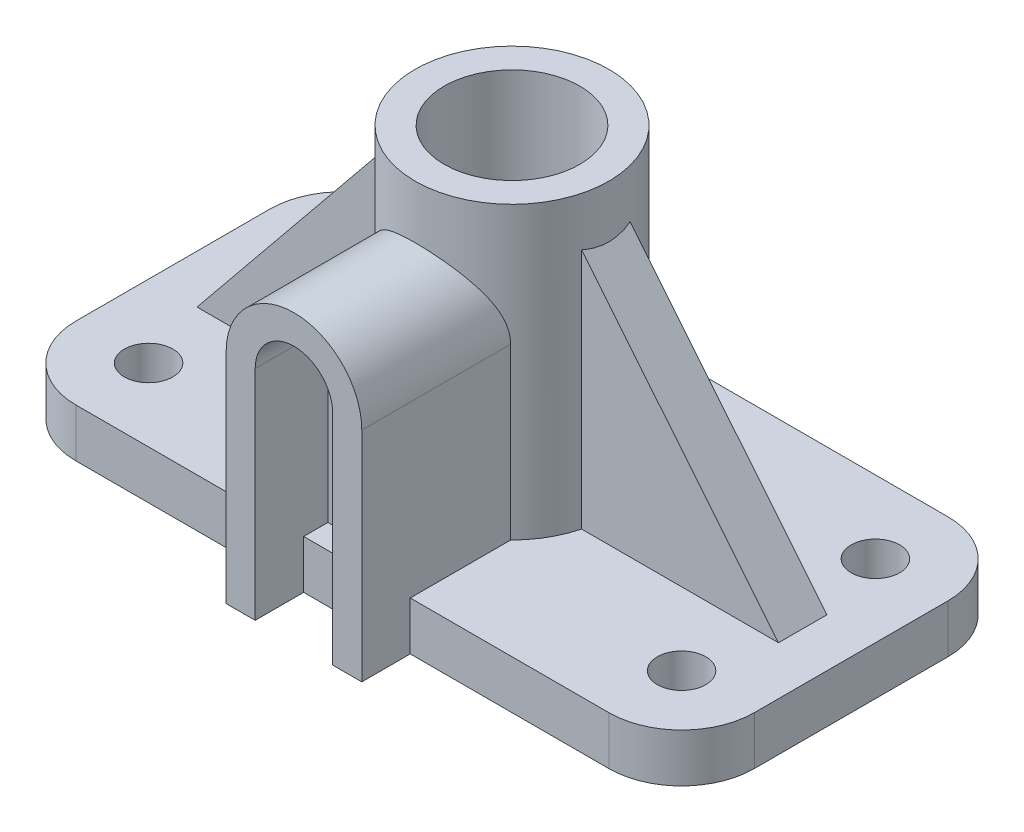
ISO-10303-21;
HEADER;
FILE_DESCRIPTION(('STEP AP214'),'2;1');
FILE_NAME('part.step','',(''),(''),'','','');
FILE_SCHEMA(('AUTOMOTIVE_DESIGN { 1 0 10303 214 1 1 1 1 }'));
ENDSEC;
DATA;
#1=APPLICATION_CONTEXT('core data for automotive mechanical design processes');
#2=APPLICATION_PROTOCOL_DEFINITION('international standard','automotive_design',2000,#1);
#3=PRODUCT_CONTEXT('',#1,'mechanical');
#4=PRODUCT('Part','Part','',(#3));
#5=PRODUCT_RELATED_PRODUCT_CATEGORY('part','',(#4));
#6=PRODUCT_DEFINITION_FORMATION('','',#4);
#7=PRODUCT_DEFINITION_CONTEXT('part definition',#1,'design');
#8=PRODUCT_DEFINITION('design','',#6,#7);
#9=PRODUCT_DEFINITION_SHAPE('','',#8);
#10=(LENGTH_UNIT() NAMED_UNIT(*) SI_UNIT(.MILLI.,.METRE.));
#11=(NAMED_UNIT(*) PLANE_ANGLE_UNIT() SI_UNIT($,.RADIAN.));
#12=(NAMED_UNIT(*) SI_UNIT($,.STERADIAN.) SOLID_ANGLE_UNIT());
#13=UNCERTAINTY_MEASURE_WITH_UNIT(LENGTH_MEASURE(1.E-05),#10,'distance_accuracy_value','');
#14=(GEOMETRIC_REPRESENTATION_CONTEXT(3) GLOBAL_UNCERTAINTY_ASSIGNED_CONTEXT((#13)) GLOBAL_UNIT_ASSIGNED_CONTEXT((#10,
#11,#12)) REPRESENTATION_CONTEXT('',''));
#15=CARTESIAN_POINT('',(0.,0.,0.));
#16=DIRECTION('',(0.,0.,1.));
#17=DIRECTION('',(1.,0.,0.));
#18=AXIS2_PLACEMENT_3D('',#15,#16,#17);
#19=CARTESIAN_POINT('',(-55.,10.,-20.));
#20=DIRECTION('',(0.,-1.,0.));
#21=DIRECTION('',(0.,0.,-1.));
#22=AXIS2_PLACEMENT_3D('',#19,#20,#21);
#23=PLANE('',#22);
#24=CARTESIAN_POINT('',(-55.,10.,-20.));
#25=DIRECTION('',(0.,1.,0.));
#26=DIRECTION('',(0.,0.,1.));
#27=AXIS2_PLACEMENT_3D('',#24,#25,#26);
#28=CIRCLE('',#27,5.);
#29=CARTESIAN_POINT('',(-55.,10.,-15.));
#30=VERTEX_POINT('',#29);
#31=EDGE_CURVE('E437',#30,#30,#28,.T.);
#32=ORIENTED_EDGE('',*,*,#31,.F.);
#33=EDGE_LOOP('',(#32));
#34=FACE_BOUND('',#33,.T.);
#35=CARTESIAN_POINT('',(55.,10.,-20.));
#36=DIRECTION('',(0.,1.,0.));
#37=DIRECTION('',(0.,0.,1.));
#38=AXIS2_PLACEMENT_3D('',#35,#36,#37);
#39=CIRCLE('',#38,5.);
#40=CARTESIAN_POINT('',(55.,10.,-15.));
#41=VERTEX_POINT('',#40);
#42=EDGE_CURVE('E449',#41,#41,#39,.T.);
#43=ORIENTED_EDGE('',*,*,#42,.F.);
#44=EDGE_LOOP('',(#43));
#45=FACE_BOUND('',#44,.T.);
#46=CARTESIAN_POINT('',(55.,10.,20.));
#47=DIRECTION('',(0.,1.,0.));
#48=DIRECTION('',(0.,0.,1.));
#49=AXIS2_PLACEMENT_3D('',#46,#47,#48);
#50=CIRCLE('',#49,5.);
#51=CARTESIAN_POINT('',(55.,10.,25.));
#52=VERTEX_POINT('',#51);
#53=EDGE_CURVE('E443',#52,#52,#50,.T.);
#54=ORIENTED_EDGE('',*,*,#53,.F.);
#55=EDGE_LOOP('',(#54));
#56=FACE_BOUND('',#55,.T.);
#57=CARTESIAN_POINT('',(-55.,10.,20.));
#58=DIRECTION('',(0.,1.,0.));
#59=DIRECTION('',(0.,0.,1.));
#60=AXIS2_PLACEMENT_3D('',#57,#58,#59);
#61=CIRCLE('',#60,5.);
#62=CARTESIAN_POINT('',(-55.,10.,25.));
#63=VERTEX_POINT('',#62);
#64=EDGE_CURVE('E431',#63,#63,#61,.T.);
#65=ORIENTED_EDGE('',*,*,#64,.F.);
#66=EDGE_LOOP('',(#65));
#67=FACE_BOUND('',#66,.T.);
#68=DIRECTION('',(1.,0.,0.));
#69=VECTOR('',#68,1.);
#70=CARTESIAN_POINT('',(-55.,10.,35.));
#71=LINE('',#70,#69);
#72=CARTESIAN_POINT('',(-55.,10.,35.));
#73=VERTEX_POINT('',#72);
#74=CARTESIAN_POINT('',(-14.,10.,35.));
#75=VERTEX_POINT('',#74);
#76=EDGE_CURVE('E464',#73,#75,#71,.T.);
#77=ORIENTED_EDGE('',*,*,#76,.T.);
#78=DIRECTION('',(0.,0.,-1.));
#79=VECTOR('',#78,1.);
#80=CARTESIAN_POINT('',(-14.,10.,-20.));
#81=LINE('',#80,#79);
#82=CARTESIAN_POINT('',(-14.,10.,14.2828568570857));
#83=VERTEX_POINT('',#82);
#84=EDGE_CURVE('E373',#75,#83,#81,.T.);
#85=ORIENTED_EDGE('',*,*,#84,.T.);
#86=CARTESIAN_POINT('',(0.,10.,0.));
#87=DIRECTION('',(0.,-1.,0.));
#88=DIRECTION('',(0.,0.,-1.));
#89=AXIS2_PLACEMENT_3D('',#86,#87,#88);
#90=CIRCLE('',#89,20.);
#91=CARTESIAN_POINT('',(-19.3649167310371,10.,5.));
#92=VERTEX_POINT('',#91);
#93=EDGE_CURVE('E40',#92,#83,#90,.F.);
#94=ORIENTED_EDGE('',*,*,#93,.F.);
#95=DIRECTION('',(-1.,0.,0.));
#96=VECTOR('',#95,1.);
#97=CARTESIAN_POINT('',(-55.,10.,5.));
#98=LINE('',#97,#96);
#99=CARTESIAN_POINT('',(-60.,10.,5.));
#100=VERTEX_POINT('',#99);
#101=EDGE_CURVE('E410',#92,#100,#98,.T.);
#102=ORIENTED_EDGE('',*,*,#101,.T.);
#103=DIRECTION('',(0.,0.,-1.));
#104=VECTOR('',#103,1.);
#105=CARTESIAN_POINT('',(-60.,10.,-20.));
#106=LINE('',#105,#104);
#107=CARTESIAN_POINT('',(-60.,10.,-5.));
#108=VERTEX_POINT('',#107);
#109=EDGE_CURVE('E415',#100,#108,#106,.T.);
#110=ORIENTED_EDGE('',*,*,#109,.T.);
#111=DIRECTION('',(-1.,0.,0.));
#112=VECTOR('',#111,1.);
#113=CARTESIAN_POINT('',(-55.,10.,-5.));
#114=LINE('',#113,#112);
#115=CARTESIAN_POINT('',(-19.3649167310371,10.,-5.));
#116=VERTEX_POINT('',#115);
#117=EDGE_CURVE('E404',#116,#108,#114,.T.);
#118=ORIENTED_EDGE('',*,*,#117,.F.);
#119=CARTESIAN_POINT('',(19.3649167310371,10.,-5.));
#120=VERTEX_POINT('',#119);
#121=EDGE_CURVE('E517',#120,#116,#90,.F.);
#122=ORIENTED_EDGE('',*,*,#121,.F.);
#123=DIRECTION('',(-1.,0.,0.));
#124=VECTOR('',#123,1.);
#125=CARTESIAN_POINT('',(-55.,10.,-5.));
#126=LINE('',#125,#124);
#127=CARTESIAN_POINT('',(60.,10.,-5.));
#128=VERTEX_POINT('',#127);
#129=EDGE_CURVE('E383',#128,#120,#126,.T.);
#130=ORIENTED_EDGE('',*,*,#129,.F.);
#131=DIRECTION('',(0.,0.,-1.));
#132=VECTOR('',#131,1.);
#133=CARTESIAN_POINT('',(60.,10.,-20.));
#134=LINE('',#133,#132);
#135=CARTESIAN_POINT('',(60.,10.,5.));
#136=VERTEX_POINT('',#135);
#137=EDGE_CURVE('E395',#128,#136,#134,.F.);
#138=ORIENTED_EDGE('',*,*,#137,.T.);
#139=DIRECTION('',(-1.,0.,0.));
#140=VECTOR('',#139,1.);
#141=CARTESIAN_POINT('',(-55.,10.,5.));
#142=LINE('',#141,#140);
#143=CARTESIAN_POINT('',(19.3649167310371,10.,5.));
#144=VERTEX_POINT('',#143);
#145=EDGE_CURVE('E389',#136,#144,#142,.T.);
#146=ORIENTED_EDGE('',*,*,#145,.T.);
#147=CARTESIAN_POINT('',(14.,10.,14.2828568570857));
#148=VERTEX_POINT('',#147);
#149=EDGE_CURVE('E519',#148,#144,#90,.F.);
#150=ORIENTED_EDGE('',*,*,#149,.F.);
#151=DIRECTION('',(0.,0.,1.));
#152=VECTOR('',#151,1.);
#153=CARTESIAN_POINT('',(14.,10.,-20.));
#154=LINE('',#153,#152);
#155=CARTESIAN_POINT('',(14.,10.,35.));
#156=VERTEX_POINT('',#155);
#157=EDGE_CURVE('E362',#148,#156,#154,.T.);
#158=ORIENTED_EDGE('',*,*,#157,.T.);
#159=CARTESIAN_POINT('',(54.9999999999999,10.,35.));
#160=VERTEX_POINT('',#159);
#161=EDGE_CURVE('E463',#156,#160,#71,.T.);
#162=ORIENTED_EDGE('',*,*,#161,.T.);
#163=CARTESIAN_POINT('',(55.,10.,20.));
#164=DIRECTION('',(0.,1.,0.));
#165=DIRECTION('',(0.,0.,1.));
#166=AXIS2_PLACEMENT_3D('',#163,#164,#165);
#167=CIRCLE('',#166,15.);
#168=CARTESIAN_POINT('',(70.,10.,19.9999999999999));
#169=VERTEX_POINT('',#168);
#170=EDGE_CURVE('E467',#160,#169,#167,.T.);
#171=ORIENTED_EDGE('',*,*,#170,.T.);
#172=DIRECTION('',(0.,0.,-1.));
#173=VECTOR('',#172,1.);
#174=CARTESIAN_POINT('',(70.,10.,-19.9999999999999));
#175=LINE('',#174,#173);
#176=CARTESIAN_POINT('',(70.,10.,-19.9999999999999));
#177=VERTEX_POINT('',#176);
#178=EDGE_CURVE('E469',#169,#177,#175,.T.);
#179=ORIENTED_EDGE('',*,*,#178,.T.);
#180=CARTESIAN_POINT('',(55.,10.,-20.));
#181=DIRECTION('',(0.,1.,0.));
#182=DIRECTION('',(0.,0.,1.));
#183=AXIS2_PLACEMENT_3D('',#180,#181,#182);
#184=CIRCLE('',#183,15.);
#185=CARTESIAN_POINT('',(54.9999999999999,10.,-35.));
#186=VERTEX_POINT('',#185);
#187=EDGE_CURVE('E471',#177,#186,#184,.T.);
#188=ORIENTED_EDGE('',*,*,#187,.T.);
#189=DIRECTION('',(-1.,0.,0.));
#190=VECTOR('',#189,1.);
#191=CARTESIAN_POINT('',(-55.,10.,-35.));
#192=LINE('',#191,#190);
#193=CARTESIAN_POINT('',(-55.,10.,-35.));
#194=VERTEX_POINT('',#193);
#195=EDGE_CURVE('E473',#186,#194,#192,.T.);
#196=ORIENTED_EDGE('',*,*,#195,.T.);
#197=CARTESIAN_POINT('',(-55.,10.,-20.));
#198=DIRECTION('',(0.,1.,0.));
#199=DIRECTION('',(0.,0.,-1.));
#200=AXIS2_PLACEMENT_3D('',#197,#198,#199);
#201=CIRCLE('',#200,15.);
#202=CARTESIAN_POINT('',(-70.,10.,-20.));
#203=VERTEX_POINT('',#202);
#204=EDGE_CURVE('E455',#194,#203,#201,.T.);
#205=ORIENTED_EDGE('',*,*,#204,.T.);
#206=DIRECTION('',(0.,0.,1.));
#207=VECTOR('',#206,1.);
#208=CARTESIAN_POINT('',(-70.,10.,-20.));
#209=LINE('',#208,#207);
#210=CARTESIAN_POINT('',(-70.,10.,20.));
#211=VERTEX_POINT('',#210);
#212=EDGE_CURVE('E458',#203,#211,#209,.T.);
#213=ORIENTED_EDGE('',*,*,#212,.T.);
#214=CARTESIAN_POINT('',(-55.,10.,20.));
#215=DIRECTION('',(0.,1.,0.));
#216=DIRECTION('',(0.,0.,-1.));
#217=AXIS2_PLACEMENT_3D('',#214,#215,#216);
#218=CIRCLE('',#217,15.);
#219=EDGE_CURVE('E461',#211,#73,#218,.T.);
#220=ORIENTED_EDGE('',*,*,#219,.T.);
#221=EDGE_LOOP('',(#77,#85,#94,#102,#110,#118,#122,#130,#138,#146,#150,#158,#162,#171,#179,#188,
#196,#205,#213,#220));
#222=FACE_BOUND('',#221,.T.);
#223=ADVANCED_FACE('F31',(#34,#45,#56,#67,#222),#23,.F.);
#224=CARTESIAN_POINT('',(-55.,10.,35.));
#225=DIRECTION('',(0.,0.,-1.));
#226=DIRECTION('',(-1.,0.,0.));
#227=AXIS2_PLACEMENT_3D('',#224,#225,#226);
#228=PLANE('',#227);
#229=ORIENTED_EDGE('',*,*,#161,.F.);
#230=DIRECTION('',(0.,-1.,0.));
#231=VECTOR('',#230,1.);
#232=CARTESIAN_POINT('',(14.,10.,35.));
#233=LINE('',#232,#231);
#234=CARTESIAN_POINT('',(14.,0.,35.));
#235=VERTEX_POINT('',#234);
#236=EDGE_CURVE('E358',#156,#235,#233,.T.);
#237=ORIENTED_EDGE('',*,*,#236,.T.);
#238=DIRECTION('',(1.,0.,0.));
#239=VECTOR('',#238,1.);
#240=CARTESIAN_POINT('',(-55.,0.,35.));
#241=LINE('',#240,#239);
#242=CARTESIAN_POINT('',(54.9999999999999,0.,35.));
#243=VERTEX_POINT('',#242);
#244=EDGE_CURVE('E482',#235,#243,#241,.T.);
#245=ORIENTED_EDGE('',*,*,#244,.T.);
#246=DIRECTION('',(0.,-1.,0.));
#247=VECTOR('',#246,1.);
#248=CARTESIAN_POINT('',(54.9999999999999,10.,35.));
#249=LINE('',#248,#247);
#250=EDGE_CURVE('E505',#160,#243,#249,.T.);
#251=ORIENTED_EDGE('',*,*,#250,.F.);
#252=EDGE_LOOP('',(#229,#237,#245,#251));
#253=FACE_BOUND('',#252,.T.);
#254=ADVANCED_FACE('F328',(#253),#228,.F.);
#255=CARTESIAN_POINT('',(-55.,0.,35.));
#256=VERTEX_POINT('',#255);
#257=CARTESIAN_POINT('',(-14.,0.,35.));
#258=VERTEX_POINT('',#257);
#259=EDGE_CURVE('E483',#256,#258,#241,.T.);
#260=ORIENTED_EDGE('',*,*,#259,.T.);
#261=DIRECTION('',(0.,1.,0.));
#262=VECTOR('',#261,1.);
#263=CARTESIAN_POINT('',(-14.,10.,35.));
#264=LINE('',#263,#262);
#265=EDGE_CURVE('E370',#258,#75,#264,.T.);
#266=ORIENTED_EDGE('',*,*,#265,.T.);
#267=ORIENTED_EDGE('',*,*,#76,.F.);
#268=DIRECTION('',(0.,-1.,0.));
#269=VECTOR('',#268,1.);
#270=CARTESIAN_POINT('',(-55.,10.,35.));
#271=LINE('',#270,#269);
#272=EDGE_CURVE('E508',#73,#256,#271,.T.);
#273=ORIENTED_EDGE('',*,*,#272,.T.);
#274=EDGE_LOOP('',(#260,#266,#267,#273));
#275=FACE_BOUND('',#274,.T.);
#276=ADVANCED_FACE('F335',(#275),#228,.F.);
#277=CARTESIAN_POINT('',(0.,70.,0.));
#278=DIRECTION('',(0.,-1.,0.));
#279=DIRECTION('',(0.,0.,-1.));
#280=AXIS2_PLACEMENT_3D('',#277,#278,#279);
#281=CYLINDRICAL_SURFACE('',#280,20.);
#282=CARTESIAN_POINT('',(0.,70.,0.));
#283=DIRECTION('',(0.,1.,0.));
#284=DIRECTION('',(0.,0.,1.));
#285=AXIS2_PLACEMENT_3D('',#282,#283,#284);
#286=CIRCLE('',#285,20.);
#287=CARTESIAN_POINT('',(0.,70.,20.));
#288=VERTEX_POINT('',#287);
#289=EDGE_CURVE('E427',#288,#288,#286,.T.);
#290=ORIENTED_EDGE('',*,*,#289,.F.);
#291=EDGE_LOOP('',(#290));
#292=FACE_BOUND('',#291,.T.);
#293=ORIENTED_EDGE('',*,*,#93,.T.);
#294=DIRECTION('',(0.,-1.,0.));
#295=VECTOR('',#294,1.);
#296=CARTESIAN_POINT('',(-14.,70.,14.2828568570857));
#297=LINE('',#296,#295);
#298=CARTESIAN_POINT('',(-14.,45.,14.2828568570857));
#299=VERTEX_POINT('',#298);
#300=EDGE_CURVE('E226',#299,#83,#297,.T.);
#301=ORIENTED_EDGE('',*,*,#300,.F.);
#302=CARTESIAN_POINT('',(14.,45.,14.2828568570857));
#303=CARTESIAN_POINT('',(14.0000031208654,45.1693514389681,14.2828475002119));
#304=CARTESIAN_POINT('',(13.9969262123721,45.3386726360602,14.2858704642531));
#305=CARTESIAN_POINT('',(13.9846515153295,45.676860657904,14.2978890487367));
#306=CARTESIAN_POINT('',(13.9754544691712,45.8457275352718,14.3068839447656));
#307=CARTESIAN_POINT('',(13.9387858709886,46.3504965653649,14.3426456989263));
#308=CARTESIAN_POINT('',(13.9022365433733,46.6851941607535,14.3781903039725));
#309=CARTESIAN_POINT('',(13.8062869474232,47.3444133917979,14.470340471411));
#310=CARTESIAN_POINT('',(13.7471414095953,47.6690063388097,14.5267110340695));
#311=CARTESIAN_POINT('',(13.6071048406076,48.3097236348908,14.6579632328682));
#312=CARTESIAN_POINT('',(13.5262061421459,48.6258449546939,14.7328513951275));
#313=CARTESIAN_POINT('',(13.3444958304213,49.2459641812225,14.8976291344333));
#314=CARTESIAN_POINT('',(13.2438108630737,49.5500251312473,14.9874227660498));
#315=CARTESIAN_POINT('',(13.0233978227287,50.1470748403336,15.1793428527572));
#316=CARTESIAN_POINT('',(12.9036710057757,50.440064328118,15.2814684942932));
#317=CARTESIAN_POINT('',(12.6458089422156,51.0152434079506,15.4955371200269));
#318=CARTESIAN_POINT('',(12.5076198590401,51.2973981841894,15.6075084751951));
#319=CARTESIAN_POINT('',(12.213945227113,51.8496250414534,15.8383850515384));
#320=CARTESIAN_POINT('',(12.058457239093,52.1196954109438,15.9572912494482));
#321=CARTESIAN_POINT('',(11.7024038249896,52.6932852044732,16.2206938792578));
#322=CARTESIAN_POINT('',(11.4986997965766,52.9944661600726,16.3660477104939));
#323=CARTESIAN_POINT('',(11.0692416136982,53.5792485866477,16.6595184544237));
#324=CARTESIAN_POINT('',(10.8434858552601,53.8628487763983,16.8076355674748));
#325=CARTESIAN_POINT('',(10.370455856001,54.4119611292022,17.1035525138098));
#326=CARTESIAN_POINT('',(10.123171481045,54.6774646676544,17.2513521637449));
#327=CARTESIAN_POINT('',(9.60772853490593,55.1893816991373,17.5436415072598));
#328=CARTESIAN_POINT('',(9.33956853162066,55.435793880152,17.6881309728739));
#329=CARTESIAN_POINT('',(8.73637325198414,55.9479393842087,17.9946805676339));
#330=CARTESIAN_POINT('',(8.39765255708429,56.2100159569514,18.15563987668));
#331=CARTESIAN_POINT('',(7.69361688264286,56.7044128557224,18.4649970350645));
#332=CARTESIAN_POINT('',(7.32829700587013,56.9367276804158,18.6133925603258));
#333=CARTESIAN_POINT('',(6.57332675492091,57.368515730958,18.8932049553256));
#334=CARTESIAN_POINT('',(6.1837137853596,57.5680378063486,19.024647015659));
#335=CARTESIAN_POINT('',(5.38216224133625,57.9315800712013,19.2667425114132));
#336=CARTESIAN_POINT('',(4.97023348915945,58.09561572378,19.3774049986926));
#337=CARTESIAN_POINT('',(4.24101036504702,58.3461565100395,19.5477343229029));
#338=CARTESIAN_POINT('',(3.92810214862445,58.4416445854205,19.6131089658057));
#339=CARTESIAN_POINT('',(3.29389105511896,58.610948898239,19.7295245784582));
#340=CARTESIAN_POINT('',(2.97258996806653,58.6847697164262,19.7805685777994));
#341=CARTESIAN_POINT('',(2.32376846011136,58.8097495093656,19.8672382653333));
#342=CARTESIAN_POINT('',(1.99625214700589,58.860922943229,19.9028737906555));
#343=CARTESIAN_POINT('',(1.33704776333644,58.9399603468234,19.9579981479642));
#344=CARTESIAN_POINT('',(1.00535955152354,58.9678235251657,19.977486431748));
#345=CARTESIAN_POINT('',(0.33962627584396,58.9998544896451,19.9998948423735));
#346=CARTESIAN_POINT('',(0.00557786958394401,59.0039757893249,20.0027824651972));
#347=CARTESIAN_POINT('',(-0.661680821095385,58.988336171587,19.9918362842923));
#348=CARTESIAN_POINT('',(-0.994891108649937,58.9685753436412,19.9780025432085));
#349=CARTESIAN_POINT('',(-1.65804364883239,58.9054616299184,19.9339247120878));
#350=CARTESIAN_POINT('',(-1.98798510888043,58.8621031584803,19.9036767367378));
#351=CARTESIAN_POINT('',(-2.64216607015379,58.75241657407,19.8274407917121));
#352=CARTESIAN_POINT('',(-2.96640556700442,58.6860884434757,19.781452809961));
#353=CARTESIAN_POINT('',(-3.59971605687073,58.5331346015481,19.6759432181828));
#354=CARTESIAN_POINT('',(-3.90896438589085,58.4470093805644,19.6167562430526));
#355=CARTESIAN_POINT('',(-4.51830677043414,58.2546965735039,19.4854316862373));
#356=CARTESIAN_POINT('',(-4.81840102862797,58.148509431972,19.4132943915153));
#357=CARTESIAN_POINT('',(-5.40804848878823,57.9171716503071,19.2573628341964));
#358=CARTESIAN_POINT('',(-5.69760147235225,57.7920206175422,19.1735683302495));
#359=CARTESIAN_POINT('',(-6.26507392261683,57.5238715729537,18.9957177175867));
#360=CARTESIAN_POINT('',(-6.54299183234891,57.3808711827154,18.9016602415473));
#361=CARTESIAN_POINT('',(-7.11677773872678,57.0611400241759,18.6937083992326));
#362=CARTESIAN_POINT('',(-7.41116267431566,56.8824249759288,18.5787723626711));
#363=CARTESIAN_POINT('',(-7.98353059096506,56.5056792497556,18.340103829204));
#364=CARTESIAN_POINT('',(-8.26151252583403,56.3076473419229,18.2163707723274));
#365=CARTESIAN_POINT('',(-8.80065371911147,55.8933094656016,17.9621101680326));
#366=CARTESIAN_POINT('',(-9.06179728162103,55.6769868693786,17.831576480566));
#367=CARTESIAN_POINT('',(-9.56647951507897,55.22725441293,17.5659842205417));
#368=CARTESIAN_POINT('',(-9.81001672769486,54.9938431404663,17.43092527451));
#369=CARTESIAN_POINT('',(-10.3209142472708,54.4676376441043,17.1342009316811));
#370=CARTESIAN_POINT('',(-10.5847674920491,54.1716805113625,16.9720895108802));
#371=CARTESIAN_POINT('',(-11.0866824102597,53.5581886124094,16.6485627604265));
#372=CARTESIAN_POINT('',(-11.3247387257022,53.2406493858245,16.4871475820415));
#373=CARTESIAN_POINT('',(-11.7741176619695,52.5847363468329,16.1692887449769));
#374=CARTESIAN_POINT('',(-11.9854365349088,52.2463596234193,16.0128457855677));
#375=CARTESIAN_POINT('',(-12.3800016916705,51.5494883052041,15.7097868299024));
#376=CARTESIAN_POINT('',(-12.5632569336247,51.1910001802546,15.5631677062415));
#377=CARTESIAN_POINT('',(-12.8611208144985,50.539718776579,15.317304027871));
#378=CARTESIAN_POINT('',(-12.9818087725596,50.2508752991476,15.2149388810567));
#379=CARTESIAN_POINT('',(-13.2046369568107,49.6622503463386,15.0219601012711));
#380=CARTESIAN_POINT('',(-13.3067772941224,49.3624689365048,14.9313463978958));
#381=CARTESIAN_POINT('',(-13.4910629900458,48.7539192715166,14.7650465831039));
#382=CARTESIAN_POINT('',(-13.5732752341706,48.4451850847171,14.689310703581));
#383=CARTESIAN_POINT('',(-13.7169378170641,47.8193397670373,14.5552489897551));
#384=CARTESIAN_POINT('',(-13.778397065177,47.5022322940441,14.4969156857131));
#385=CARTESIAN_POINT('',(-13.8853344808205,46.8243511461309,14.3945717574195));
#386=CARTESIAN_POINT('',(-13.9281440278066,46.4627671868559,14.3529962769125));
#387=CARTESIAN_POINT('',(-13.971157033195,45.9167018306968,14.3110839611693));
#388=CARTESIAN_POINT('',(-13.9819613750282,45.7337401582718,14.3005212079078));
#389=CARTESIAN_POINT('',(-13.9963861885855,45.3671992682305,14.2864000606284));
#390=CARTESIAN_POINT('',(-14.0000040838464,45.1836198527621,14.2828441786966));
#391=CARTESIAN_POINT('',(-14.,45.,14.2828568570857));
#392=B_SPLINE_CURVE_WITH_KNOTS('',3,(#302,#303,#304,#305,#306,#307,#308,#309,#310,#311,#312,
#313,#314,#315,#316,#317,#318,#319,#320,#321,#322,#323,#324,#325,#326,#327,#328,#329,#330,#331,
#332,#333,#334,#335,#336,#337,#338,#339,#340,#341,#342,#343,#344,#345,#346,#347,#348,#349,#350,
#351,#352,#353,#354,#355,#356,#357,#358,#359,#360,#361,#362,#363,#364,#365,#366,#367,#368,#369,
#370,#371,#372,#373,#374,#375,#376,#377,#378,#379,#380,#381,#382,#383,#384,#385,#386,#387,#388,
#389,#390,#391),.UNSPECIFIED.,.F.,.F.,(4,2,2,2,2,2,2,2,2,2,2,2,2,2,2,2,2,2,2,2,2,2,2,2,2,2,2,2,
2,2,2,2,2,2,2,2,2,2,2,2,2,2,2,2,4),(0.,0.507940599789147,1.01581959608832,2.02970511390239,
3.03248299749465,4.03561479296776,5.03252352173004,6.02936651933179,7.02918251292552,
8.02913966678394,9.20279086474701,10.3765274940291,11.5508196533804,12.7251924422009,
14.0958940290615,15.4668486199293,16.8357420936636,18.2040378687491,19.2038828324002,
20.2035162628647,21.2025105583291,22.2015387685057,23.2025224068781,24.2035022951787,
25.2047192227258,26.2059369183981,27.1841884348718,28.1624182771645,29.1406683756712,
30.1190489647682,31.2071685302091,32.2953574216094,33.3845464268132,34.4738255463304,
35.7575382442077,37.0415170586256,38.325675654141,39.6094234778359,40.5966766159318,
41.5839238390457,42.5678101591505,43.551273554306,44.6484222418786,45.1989360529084,
45.749647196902),.UNSPECIFIED.);
#393=CARTESIAN_POINT('',(14.,45.,14.2828568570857));
#394=VERTEX_POINT('',#393);
#395=EDGE_CURVE('E278',#394,#299,#392,.T.);
#396=ORIENTED_EDGE('',*,*,#395,.F.);
#397=DIRECTION('',(0.,-1.,0.));
#398=VECTOR('',#397,1.);
#399=CARTESIAN_POINT('',(14.,70.,14.2828568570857));
#400=LINE('',#399,#398);
#401=EDGE_CURVE('E11',#394,#148,#400,.T.);
#402=ORIENTED_EDGE('',*,*,#401,.T.);
#403=ORIENTED_EDGE('',*,*,#149,.T.);
#404=DIRECTION('',(0.,-1.,0.));
#405=VECTOR('',#404,1.);
#406=CARTESIAN_POINT('',(19.3649167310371,70.,5.));
#407=LINE('',#406,#405);
#408=CARTESIAN_POINT('',(19.3649167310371,59.9180979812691,5.));
#409=VERTEX_POINT('',#408);
#410=EDGE_CURVE('E386',#144,#409,#407,.F.);
#411=ORIENTED_EDGE('',*,*,#410,.T.);
#412=CARTESIAN_POINT('',(0.,83.7068965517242,0.));
#413=DIRECTION('',(-0.775531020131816,-0.63130946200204,0.));
#414=DIRECTION('',(0.63130946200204,-0.775531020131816,0.));
#415=AXIS2_PLACEMENT_3D('',#412,#413,#414);
#416=ELLIPSE('',#415,31.6801841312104,20.);
#417=CARTESIAN_POINT('',(19.3649167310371,59.9180979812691,-5.));
#418=VERTEX_POINT('',#417);
#419=EDGE_CURVE('E392',#409,#418,#416,.F.);
#420=ORIENTED_EDGE('',*,*,#419,.T.);
#421=DIRECTION('',(0.,-1.,0.));
#422=VECTOR('',#421,1.);
#423=CARTESIAN_POINT('',(19.3649167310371,70.,-5.));
#424=LINE('',#423,#422);
#425=EDGE_CURVE('E380',#120,#418,#424,.F.);
#426=ORIENTED_EDGE('',*,*,#425,.F.);
#427=ORIENTED_EDGE('',*,*,#121,.T.);
#428=DIRECTION('',(0.,-1.,0.));
#429=VECTOR('',#428,1.);
#430=CARTESIAN_POINT('',(-19.3649167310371,70.,-5.));
#431=LINE('',#430,#429);
#432=CARTESIAN_POINT('',(-19.3649167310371,59.9180979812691,-5.));
#433=VERTEX_POINT('',#432);
#434=EDGE_CURVE('E401',#433,#116,#431,.T.);
#435=ORIENTED_EDGE('',*,*,#434,.F.);
#436=CARTESIAN_POINT('',(0.,83.7068965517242,0.));
#437=DIRECTION('',(-0.775531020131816,0.63130946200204,0.));
#438=DIRECTION('',(-0.63130946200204,-0.775531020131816,0.));
#439=AXIS2_PLACEMENT_3D('',#436,#437,#438);
#440=ELLIPSE('',#439,31.6801841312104,20.);
#441=CARTESIAN_POINT('',(-19.3649167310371,59.9180979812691,5.));
#442=VERTEX_POINT('',#441);
#443=EDGE_CURVE('E412',#433,#442,#440,.T.);
#444=ORIENTED_EDGE('',*,*,#443,.T.);
#445=DIRECTION('',(0.,-1.,0.));
#446=VECTOR('',#445,1.);
#447=CARTESIAN_POINT('',(-19.3649167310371,70.,5.));
#448=LINE('',#447,#446);
#449=EDGE_CURVE('E407',#442,#92,#448,.T.);
#450=ORIENTED_EDGE('',*,*,#449,.T.);
#451=EDGE_LOOP('',(#293,#301,#396,#402,#403,#411,#420,#426,#427,#435,#444,#450));
#452=FACE_BOUND('',#451,.T.);
#453=ADVANCED_FACE('F351',(#292,#452),#281,.T.);
#454=CARTESIAN_POINT('',(0.,0.,0.));
#455=DIRECTION('',(0.,1.,0.));
#456=DIRECTION('',(0.,0.,1.));
#457=AXIS2_PLACEMENT_3D('',#454,#455,#456);
#458=CYLINDRICAL_SURFACE('',#457,7.5);
#459=CARTESIAN_POINT('',(0.,0.,0.));
#460=DIRECTION('',(0.,1.,0.));
#461=DIRECTION('',(0.,0.,1.));
#462=AXIS2_PLACEMENT_3D('',#459,#460,#461);
#463=CIRCLE('',#462,7.5);
#464=CARTESIAN_POINT('',(0.,0.,7.5));
#465=VERTEX_POINT('',#464);
#466=EDGE_CURVE('E424',#465,#465,#463,.T.);
#467=ORIENTED_EDGE('',*,*,#466,.F.);
#468=EDGE_LOOP('',(#467));
#469=FACE_BOUND('',#468,.T.);
#470=CARTESIAN_POINT('',(0.,30.,0.));
#471=DIRECTION('',(0.,1.,0.));
#472=DIRECTION('',(0.,0.,1.));
#473=AXIS2_PLACEMENT_3D('',#470,#471,#472);
#474=CIRCLE('',#473,7.5);
#475=CARTESIAN_POINT('',(0.,30.,7.5));
#476=VERTEX_POINT('',#475);
#477=EDGE_CURVE('E421',#476,#476,#474,.F.);
#478=ORIENTED_EDGE('',*,*,#477,.F.);
#479=EDGE_LOOP('',(#478));
#480=FACE_BOUND('',#479,.T.);
#481=ADVANCED_FACE('F345',(#469,#480),#458,.F.);
#482=DIRECTION('',(0.,0.,-1.));
#483=VECTOR('',#482,1.);
#484=CARTESIAN_POINT('',(7.99999999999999,10.,-20.));
#485=LINE('',#484,#483);
#486=CARTESIAN_POINT('',(8.,10.,35.));
#487=VERTEX_POINT('',#486);
#488=CARTESIAN_POINT('',(7.99999999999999,10.,30.));
#489=VERTEX_POINT('',#488);
#490=EDGE_CURVE('E354',#487,#489,#485,.T.);
#491=ORIENTED_EDGE('',*,*,#490,.T.);
#492=DIRECTION('',(1.,0.,0.));
#493=VECTOR('',#492,1.);
#494=CARTESIAN_POINT('',(-8.,10.,30.));
#495=LINE('',#494,#493);
#496=CARTESIAN_POINT('',(-8.,10.,30.));
#497=VERTEX_POINT('',#496);
#498=EDGE_CURVE('E55',#497,#489,#495,.T.);
#499=ORIENTED_EDGE('',*,*,#498,.F.);
#500=DIRECTION('',(0.,0.,1.));
#501=VECTOR('',#500,1.);
#502=CARTESIAN_POINT('',(-8.,10.,-20.));
#503=LINE('',#502,#501);
#504=CARTESIAN_POINT('',(-8.,10.,35.));
#505=VERTEX_POINT('',#504);
#506=EDGE_CURVE('E364',#497,#505,#503,.T.);
#507=ORIENTED_EDGE('',*,*,#506,.T.);
#508=EDGE_CURVE('E356',#505,#487,#71,.T.);
#509=ORIENTED_EDGE('',*,*,#508,.T.);
#510=EDGE_LOOP('',(#491,#499,#507,#509));
#511=FACE_BOUND('',#510,.T.);
#512=ADVANCED_FACE('F331',(#511),#23,.F.);
#513=CARTESIAN_POINT('',(-55.,0.,-20.));
#514=DIRECTION('',(0.,-1.,0.));
#515=DIRECTION('',(0.,0.,-1.));
#516=AXIS2_PLACEMENT_3D('',#513,#514,#515);
#517=PLANE('',#516);
#518=ORIENTED_EDGE('',*,*,#244,.F.);
#519=DIRECTION('',(0.,0.,1.));
#520=VECTOR('',#519,1.);
#521=CARTESIAN_POINT('',(14.,0.,-35.001));
#522=LINE('',#521,#520);
#523=CARTESIAN_POINT('',(14.,0.,45.));
#524=VERTEX_POINT('',#523);
#525=EDGE_CURVE('E551',#235,#524,#522,.T.);
#526=ORIENTED_EDGE('',*,*,#525,.T.);
#527=DIRECTION('',(1.,0.,0.));
#528=VECTOR('',#527,1.);
#529=CARTESIAN_POINT('',(8.,0.,45.));
#530=LINE('',#529,#528);
#531=CARTESIAN_POINT('',(8.,0.,45.));
#532=VERTEX_POINT('',#531);
#533=EDGE_CURVE('E869',#532,#524,#530,.T.);
#534=ORIENTED_EDGE('',*,*,#533,.F.);
#535=DIRECTION('',(0.,0.,1.));
#536=VECTOR('',#535,1.);
#537=CARTESIAN_POINT('',(8.,0.,-35.001));
#538=LINE('',#537,#536);
#539=CARTESIAN_POINT('',(8.,0.,35.));
#540=VERTEX_POINT('',#539);
#541=EDGE_CURVE('E222',#540,#532,#538,.T.);
#542=ORIENTED_EDGE('',*,*,#541,.F.);
#543=CARTESIAN_POINT('',(-8.,0.,35.));
#544=VERTEX_POINT('',#543);
#545=EDGE_CURVE('E487',#544,#540,#241,.T.);
#546=ORIENTED_EDGE('',*,*,#545,.F.);
#547=DIRECTION('',(0.,0.,1.));
#548=VECTOR('',#547,1.);
#549=CARTESIAN_POINT('',(-8.,0.,-35.001));
#550=LINE('',#549,#548);
#551=CARTESIAN_POINT('',(-8.,0.,45.));
#552=VERTEX_POINT('',#551);
#553=EDGE_CURVE('E225',#544,#552,#550,.T.);
#554=ORIENTED_EDGE('',*,*,#553,.T.);
#555=DIRECTION('',(1.,0.,0.));
#556=VECTOR('',#555,1.);
#557=CARTESIAN_POINT('',(-8.,0.,45.));
#558=LINE('',#557,#556);
#559=CARTESIAN_POINT('',(-14.,0.,45.));
#560=VERTEX_POINT('',#559);
#561=EDGE_CURVE('E239',#560,#552,#558,.T.);
#562=ORIENTED_EDGE('',*,*,#561,.F.);
#563=DIRECTION('',(0.,0.,1.));
#564=VECTOR('',#563,1.);
#565=CARTESIAN_POINT('',(-14.,0.,-35.001));
#566=LINE('',#565,#564);
#567=EDGE_CURVE('E285',#258,#560,#566,.T.);
#568=ORIENTED_EDGE('',*,*,#567,.F.);
#569=ORIENTED_EDGE('',*,*,#259,.F.);
#570=CARTESIAN_POINT('',(-55.,0.,20.));
#571=DIRECTION('',(0.,1.,0.));
#572=DIRECTION('',(0.,0.,-1.));
#573=AXIS2_PLACEMENT_3D('',#570,#571,#572);
#574=CIRCLE('',#573,15.);
#575=CARTESIAN_POINT('',(-70.,0.,20.));
#576=VERTEX_POINT('',#575);
#577=EDGE_CURVE('E480',#576,#256,#574,.T.);
#578=ORIENTED_EDGE('',*,*,#577,.F.);
#579=DIRECTION('',(0.,0.,1.));
#580=VECTOR('',#579,1.);
#581=CARTESIAN_POINT('',(-70.,0.,-20.));
#582=LINE('',#581,#580);
#583=CARTESIAN_POINT('',(-70.,0.,-20.));
#584=VERTEX_POINT('',#583);
#585=EDGE_CURVE('E478',#584,#576,#582,.T.);
#586=ORIENTED_EDGE('',*,*,#585,.F.);
#587=CARTESIAN_POINT('',(-55.,0.,-20.));
#588=DIRECTION('',(0.,1.,0.));
#589=DIRECTION('',(0.,0.,-1.));
#590=AXIS2_PLACEMENT_3D('',#587,#588,#589);
#591=CIRCLE('',#590,15.);
#592=CARTESIAN_POINT('',(-55.,0.,-35.));
#593=VERTEX_POINT('',#592);
#594=EDGE_CURVE('E452',#593,#584,#591,.T.);
#595=ORIENTED_EDGE('',*,*,#594,.F.);
#596=DIRECTION('',(-1.,0.,0.));
#597=VECTOR('',#596,1.);
#598=CARTESIAN_POINT('',(-55.,0.,-35.));
#599=LINE('',#598,#597);
#600=CARTESIAN_POINT('',(54.9999999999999,0.,-35.));
#601=VERTEX_POINT('',#600);
#602=EDGE_CURVE('E459',#601,#593,#599,.T.);
#603=ORIENTED_EDGE('',*,*,#602,.F.);
#604=CARTESIAN_POINT('',(55.,0.,-20.));
#605=DIRECTION('',(0.,1.,0.));
#606=DIRECTION('',(0.,0.,1.));
#607=AXIS2_PLACEMENT_3D('',#604,#605,#606);
#608=CIRCLE('',#607,15.);
#609=CARTESIAN_POINT('',(70.,0.,-19.9999999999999));
#610=VERTEX_POINT('',#609);
#611=EDGE_CURVE('E491',#610,#601,#608,.T.);
#612=ORIENTED_EDGE('',*,*,#611,.F.);
#613=DIRECTION('',(0.,0.,-1.));
#614=VECTOR('',#613,1.);
#615=CARTESIAN_POINT('',(70.,0.,-19.9999999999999));
#616=LINE('',#615,#614);
#617=CARTESIAN_POINT('',(70.,0.,19.9999999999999));
#618=VERTEX_POINT('',#617);
#619=EDGE_CURVE('E489',#618,#610,#616,.T.);
#620=ORIENTED_EDGE('',*,*,#619,.F.);
#621=CARTESIAN_POINT('',(55.,0.,20.));
#622=DIRECTION('',(0.,1.,0.));
#623=DIRECTION('',(0.,0.,1.));
#624=AXIS2_PLACEMENT_3D('',#621,#622,#623);
#625=CIRCLE('',#624,15.);
#626=EDGE_CURVE('E486',#243,#618,#625,.T.);
#627=ORIENTED_EDGE('',*,*,#626,.F.);
#628=EDGE_LOOP('',(#518,#526,#534,#542,#546,#554,#562,#568,#569,#578,#586,#595,#603,#612,#620,#627));
#629=FACE_BOUND('',#628,.T.);
#630=ORIENTED_EDGE('',*,*,#466,.T.);
#631=EDGE_LOOP('',(#630));
#632=FACE_BOUND('',#631,.T.);
#633=CARTESIAN_POINT('',(-55.,0.,-20.));
#634=DIRECTION('',(0.,1.,0.));
#635=DIRECTION('',(0.,0.,1.));
#636=AXIS2_PLACEMENT_3D('',#633,#634,#635);
#637=CIRCLE('',#636,5.);
#638=CARTESIAN_POINT('',(-55.,0.,-15.));
#639=VERTEX_POINT('',#638);
#640=EDGE_CURVE('E434',#639,#639,#637,.T.);
#641=ORIENTED_EDGE('',*,*,#640,.T.);
#642=EDGE_LOOP('',(#641));
#643=FACE_BOUND('',#642,.T.);
#644=CARTESIAN_POINT('',(55.,0.,-20.));
#645=DIRECTION('',(0.,1.,0.));
#646=DIRECTION('',(0.,0.,1.));
#647=AXIS2_PLACEMENT_3D('',#644,#645,#646);
#648=CIRCLE('',#647,5.);
#649=CARTESIAN_POINT('',(55.,0.,-15.));
#650=VERTEX_POINT('',#649);
#651=EDGE_CURVE('E446',#650,#650,#648,.T.);
#652=ORIENTED_EDGE('',*,*,#651,.T.);
#653=EDGE_LOOP('',(#652));
#654=FACE_BOUND('',#653,.T.);
#655=CARTESIAN_POINT('',(55.,0.,20.));
#656=DIRECTION('',(0.,1.,0.));
#657=DIRECTION('',(0.,0.,1.));
#658=AXIS2_PLACEMENT_3D('',#655,#656,#657);
#659=CIRCLE('',#658,5.);
#660=CARTESIAN_POINT('',(55.,0.,25.));
#661=VERTEX_POINT('',#660);
#662=EDGE_CURVE('E440',#661,#661,#659,.T.);
#663=ORIENTED_EDGE('',*,*,#662,.T.);
#664=EDGE_LOOP('',(#663));
#665=FACE_BOUND('',#664,.T.);
#666=CARTESIAN_POINT('',(-55.,0.,20.));
#667=DIRECTION('',(0.,1.,0.));
#668=DIRECTION('',(0.,0.,1.));
#669=AXIS2_PLACEMENT_3D('',#666,#667,#668);
#670=CIRCLE('',#669,5.);
#671=CARTESIAN_POINT('',(-55.,0.,25.));
#672=VERTEX_POINT('',#671);
#673=EDGE_CURVE('E430',#672,#672,#670,.T.);
#674=ORIENTED_EDGE('',*,*,#673,.T.);
#675=EDGE_LOOP('',(#674));
#676=FACE_BOUND('',#675,.T.);
#677=ADVANCED_FACE('F344',(#629,#632,#643,#654,#665,#676),#517,.T.);
#678=CARTESIAN_POINT('',(-55.,10.,-20.));
#679=DIRECTION('',(0.,-1.,0.));
#680=DIRECTION('',(0.,0.,-1.));
#681=AXIS2_PLACEMENT_3D('',#678,#679,#680);
#682=CYLINDRICAL_SURFACE('',#681,15.);
#683=ORIENTED_EDGE('',*,*,#594,.T.);
#684=DIRECTION('',(0.,-1.,0.));
#685=VECTOR('',#684,1.);
#686=CARTESIAN_POINT('',(-70.,10.,-20.));
#687=LINE('',#686,#685);
#688=EDGE_CURVE('E514',#203,#584,#687,.T.);
#689=ORIENTED_EDGE('',*,*,#688,.F.);
#690=ORIENTED_EDGE('',*,*,#204,.F.);
#691=DIRECTION('',(0.,-1.,0.));
#692=VECTOR('',#691,1.);
#693=CARTESIAN_POINT('',(-55.,10.,-35.));
#694=LINE('',#693,#692);
#695=EDGE_CURVE('E475',#194,#593,#694,.T.);
#696=ORIENTED_EDGE('',*,*,#695,.T.);
#697=EDGE_LOOP('',(#683,#689,#690,#696));
#698=FACE_BOUND('',#697,.T.);
#699=ADVANCED_FACE('F33',(#698),#682,.T.);
#700=CARTESIAN_POINT('',(-70.,10.,-20.));
#701=DIRECTION('',(1.,0.,0.));
#702=DIRECTION('',(0.,0.,-1.));
#703=AXIS2_PLACEMENT_3D('',#700,#701,#702);
#704=PLANE('',#703);
#705=DIRECTION('',(0.,-1.,0.));
#706=VECTOR('',#705,1.);
#707=CARTESIAN_POINT('',(-70.,10.,20.));
#708=LINE('',#707,#706);
#709=EDGE_CURVE('E511',#211,#576,#708,.T.);
#710=ORIENTED_EDGE('',*,*,#709,.F.);
#711=ORIENTED_EDGE('',*,*,#212,.F.);
#712=ORIENTED_EDGE('',*,*,#688,.T.);
#713=ORIENTED_EDGE('',*,*,#585,.T.);
#714=EDGE_LOOP('',(#710,#711,#712,#713));
#715=FACE_BOUND('',#714,.T.);
#716=ADVANCED_FACE('F592',(#715),#704,.F.);
#717=CARTESIAN_POINT('',(-55.,10.,20.));
#718=DIRECTION('',(0.,-1.,0.));
#719=DIRECTION('',(0.,0.,-1.));
#720=AXIS2_PLACEMENT_3D('',#717,#718,#719);
#721=CYLINDRICAL_SURFACE('',#720,15.);
#722=ORIENTED_EDGE('',*,*,#577,.T.);
#723=ORIENTED_EDGE('',*,*,#272,.F.);
#724=ORIENTED_EDGE('',*,*,#219,.F.);
#725=ORIENTED_EDGE('',*,*,#709,.T.);
#726=EDGE_LOOP('',(#722,#723,#724,#725));
#727=FACE_BOUND('',#726,.T.);
#728=ADVANCED_FACE('F594',(#727),#721,.T.);
#729=ORIENTED_EDGE('',*,*,#545,.T.);
#730=DIRECTION('',(0.,1.,0.));
#731=VECTOR('',#730,1.);
#732=CARTESIAN_POINT('',(8.,10.,35.));
#733=LINE('',#732,#731);
#734=EDGE_CURVE('E359',#540,#487,#733,.T.);
#735=ORIENTED_EDGE('',*,*,#734,.T.);
#736=ORIENTED_EDGE('',*,*,#508,.F.);
#737=DIRECTION('',(0.,-1.,0.));
#738=VECTOR('',#737,1.);
#739=CARTESIAN_POINT('',(-8.,10.,35.));
#740=LINE('',#739,#738);
#741=EDGE_CURVE('E554',#505,#544,#740,.T.);
#742=ORIENTED_EDGE('',*,*,#741,.T.);
#743=EDGE_LOOP('',(#729,#735,#736,#742));
#744=FACE_BOUND('',#743,.T.);
#745=ADVANCED_FACE('F338',(#744),#228,.F.);
#746=CARTESIAN_POINT('',(55.,10.,20.));
#747=DIRECTION('',(0.,-1.,0.));
#748=DIRECTION('',(0.,0.,-1.));
#749=AXIS2_PLACEMENT_3D('',#746,#747,#748);
#750=CYLINDRICAL_SURFACE('',#749,15.);
#751=ORIENTED_EDGE('',*,*,#626,.T.);
#752=DIRECTION('',(0.,-1.,0.));
#753=VECTOR('',#752,1.);
#754=CARTESIAN_POINT('',(70.,10.,19.9999999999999));
#755=LINE('',#754,#753);
#756=EDGE_CURVE('E502',#169,#618,#755,.T.);
#757=ORIENTED_EDGE('',*,*,#756,.F.);
#758=ORIENTED_EDGE('',*,*,#170,.F.);
#759=ORIENTED_EDGE('',*,*,#250,.T.);
#760=EDGE_LOOP('',(#751,#757,#758,#759));
#761=FACE_BOUND('',#760,.T.);
#762=ADVANCED_FACE('F569',(#761),#750,.T.);
#763=CARTESIAN_POINT('',(70.,10.,-19.9999999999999));
#764=DIRECTION('',(-1.,0.,0.));
#765=DIRECTION('',(0.,0.,1.));
#766=AXIS2_PLACEMENT_3D('',#763,#764,#765);
#767=PLANE('',#766);
#768=ORIENTED_EDGE('',*,*,#619,.T.);
#769=DIRECTION('',(0.,-1.,0.));
#770=VECTOR('',#769,1.);
#771=CARTESIAN_POINT('',(70.,10.,-19.9999999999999));
#772=LINE('',#771,#770);
#773=EDGE_CURVE('E499',#177,#610,#772,.T.);
#774=ORIENTED_EDGE('',*,*,#773,.F.);
#775=ORIENTED_EDGE('',*,*,#178,.F.);
#776=ORIENTED_EDGE('',*,*,#756,.T.);
#777=EDGE_LOOP('',(#768,#774,#775,#776));
#778=FACE_BOUND('',#777,.T.);
#779=ADVANCED_FACE('F574',(#778),#767,.F.);
#780=CARTESIAN_POINT('',(55.,10.,-20.));
#781=DIRECTION('',(0.,-1.,0.));
#782=DIRECTION('',(0.,0.,-1.));
#783=AXIS2_PLACEMENT_3D('',#780,#781,#782);
#784=CYLINDRICAL_SURFACE('',#783,15.);
#785=ORIENTED_EDGE('',*,*,#611,.T.);
#786=DIRECTION('',(0.,-1.,0.));
#787=VECTOR('',#786,1.);
#788=CARTESIAN_POINT('',(54.9999999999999,10.,-35.));
#789=LINE('',#788,#787);
#790=EDGE_CURVE('E496',#186,#601,#789,.T.);
#791=ORIENTED_EDGE('',*,*,#790,.F.);
#792=ORIENTED_EDGE('',*,*,#187,.F.);
#793=ORIENTED_EDGE('',*,*,#773,.T.);
#794=EDGE_LOOP('',(#785,#791,#792,#793));
#795=FACE_BOUND('',#794,.T.);
#796=ADVANCED_FACE('F580',(#795),#784,.T.);
#797=CARTESIAN_POINT('',(-55.,10.,-35.));
#798=DIRECTION('',(0.,0.,1.));
#799=DIRECTION('',(1.,0.,0.));
#800=AXIS2_PLACEMENT_3D('',#797,#798,#799);
#801=PLANE('',#800);
#802=ORIENTED_EDGE('',*,*,#602,.T.);
#803=ORIENTED_EDGE('',*,*,#695,.F.);
#804=ORIENTED_EDGE('',*,*,#195,.F.);
#805=ORIENTED_EDGE('',*,*,#790,.T.);
#806=EDGE_LOOP('',(#802,#803,#804,#805));
#807=FACE_BOUND('',#806,.T.);
#808=ADVANCED_FACE('F584',(#807),#801,.F.);
#809=CARTESIAN_POINT('',(55.,10.,-20.));
#810=DIRECTION('',(0.,-1.,0.));
#811=DIRECTION('',(0.,0.,-1.));
#812=AXIS2_PLACEMENT_3D('',#809,#810,#811);
#813=CYLINDRICAL_SURFACE('',#812,5.);
#814=ORIENTED_EDGE('',*,*,#42,.T.);
#815=EDGE_LOOP('',(#814));
#816=FACE_BOUND('',#815,.T.);
#817=ORIENTED_EDGE('',*,*,#651,.F.);
#818=EDGE_LOOP('',(#817));
#819=FACE_BOUND('',#818,.T.);
#820=ADVANCED_FACE('F609',(#816,#819),#813,.F.);
#821=CARTESIAN_POINT('',(55.,10.,20.));
#822=DIRECTION('',(0.,-1.,0.));
#823=DIRECTION('',(0.,0.,-1.));
#824=AXIS2_PLACEMENT_3D('',#821,#822,#823);
#825=CYLINDRICAL_SURFACE('',#824,5.);
#826=ORIENTED_EDGE('',*,*,#53,.T.);
#827=EDGE_LOOP('',(#826));
#828=FACE_BOUND('',#827,.T.);
#829=ORIENTED_EDGE('',*,*,#662,.F.);
#830=EDGE_LOOP('',(#829));
#831=FACE_BOUND('',#830,.T.);
#832=ADVANCED_FACE('F613',(#828,#831),#825,.F.);
#833=CARTESIAN_POINT('',(-55.,10.,-20.));
#834=DIRECTION('',(0.,-1.,0.));
#835=DIRECTION('',(0.,0.,-1.));
#836=AXIS2_PLACEMENT_3D('',#833,#834,#835);
#837=CYLINDRICAL_SURFACE('',#836,5.);
#838=ORIENTED_EDGE('',*,*,#31,.T.);
#839=EDGE_LOOP('',(#838));
#840=FACE_BOUND('',#839,.T.);
#841=ORIENTED_EDGE('',*,*,#640,.F.);
#842=EDGE_LOOP('',(#841));
#843=FACE_BOUND('',#842,.T.);
#844=ADVANCED_FACE('F618',(#840,#843),#837,.F.);
#845=CARTESIAN_POINT('',(-55.,10.,20.));
#846=DIRECTION('',(0.,-1.,0.));
#847=DIRECTION('',(0.,0.,-1.));
#848=AXIS2_PLACEMENT_3D('',#845,#846,#847);
#849=CYLINDRICAL_SURFACE('',#848,5.);
#850=ORIENTED_EDGE('',*,*,#64,.T.);
#851=EDGE_LOOP('',(#850));
#852=FACE_BOUND('',#851,.T.);
#853=ORIENTED_EDGE('',*,*,#673,.F.);
#854=EDGE_LOOP('',(#853));
#855=FACE_BOUND('',#854,.T.);
#856=ADVANCED_FACE('F322',(#852,#855),#849,.F.);
#857=CARTESIAN_POINT('',(0.,70.,0.));
#858=DIRECTION('',(0.,1.,0.));
#859=DIRECTION('',(0.,0.,1.));
#860=AXIS2_PLACEMENT_3D('',#857,#858,#859);
#861=PLANE('',#860);
#862=CARTESIAN_POINT('',(0.,70.,0.));
#863=DIRECTION('',(0.,1.,0.));
#864=DIRECTION('',(0.,0.,1.));
#865=AXIS2_PLACEMENT_3D('',#862,#863,#864);
#866=CIRCLE('',#865,14.);
#867=CARTESIAN_POINT('',(0.,70.,14.));
#868=VERTEX_POINT('',#867);
#869=EDGE_CURVE('E417',#868,#868,#866,.T.);
#870=ORIENTED_EDGE('',*,*,#869,.F.);
#871=EDGE_LOOP('',(#870));
#872=FACE_BOUND('',#871,.T.);
#873=ORIENTED_EDGE('',*,*,#289,.T.);
#874=EDGE_LOOP('',(#873));
#875=FACE_BOUND('',#874,.T.);
#876=ADVANCED_FACE('F315',(#872,#875),#861,.T.);
#877=CARTESIAN_POINT('',(0.,30.,0.));
#878=DIRECTION('',(0.,1.,0.));
#879=DIRECTION('',(0.,0.,1.));
#880=AXIS2_PLACEMENT_3D('',#877,#878,#879);
#881=PLANE('',#880);
#882=ORIENTED_EDGE('',*,*,#477,.T.);
#883=EDGE_LOOP('',(#882));
#884=FACE_BOUND('',#883,.T.);
#885=CARTESIAN_POINT('',(0.,30.,0.));
#886=DIRECTION('',(0.,1.,0.));
#887=DIRECTION('',(0.,0.,1.));
#888=AXIS2_PLACEMENT_3D('',#885,#886,#887);
#889=CIRCLE('',#888,14.);
#890=CARTESIAN_POINT('',(0.,30.,14.));
#891=VERTEX_POINT('',#890);
#892=EDGE_CURVE('E418',#891,#891,#889,.T.);
#893=ORIENTED_EDGE('',*,*,#892,.T.);
#894=EDGE_LOOP('',(#893));
#895=FACE_BOUND('',#894,.T.);
#896=ADVANCED_FACE('F313',(#884,#895),#881,.T.);
#897=CARTESIAN_POINT('',(0.,30.,0.));
#898=DIRECTION('',(0.,1.,0.));
#899=DIRECTION('',(0.,0.,1.));
#900=AXIS2_PLACEMENT_3D('',#897,#898,#899);
#901=CYLINDRICAL_SURFACE('',#900,14.);
#902=CARTESIAN_POINT('',(0.,37.,14.));
#903=CARTESIAN_POINT('',(0.206348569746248,37.0000017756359,13.9999983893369));
#904=CARTESIAN_POINT('',(0.412761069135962,37.0079963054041,13.9954259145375));
#905=CARTESIAN_POINT('',(0.824045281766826,37.0398781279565,13.9772448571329));
#906=CARTESIAN_POINT('',(1.02891595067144,37.0637753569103,13.9636306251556));
#907=CARTESIAN_POINT('',(1.43586653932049,37.1272130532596,13.9276735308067));
#908=CARTESIAN_POINT('',(1.63794007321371,37.16678464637,13.905313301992));
#909=CARTESIAN_POINT('',(2.03750144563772,37.2610886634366,13.8524086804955));
#910=CARTESIAN_POINT('',(2.23498729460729,37.3158275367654,13.8218608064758));
#911=CARTESIAN_POINT('',(2.6229866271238,37.4394982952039,13.753492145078));
#912=CARTESIAN_POINT('',(2.81353117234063,37.5083544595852,13.7157102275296));
#913=CARTESIAN_POINT('',(3.1877160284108,37.6597531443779,13.6336047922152));
#914=CARTESIAN_POINT('',(3.37135364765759,37.7423009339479,13.5892787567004));
#915=CARTESIAN_POINT('',(3.73061544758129,37.9202643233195,13.4950716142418));
#916=CARTESIAN_POINT('',(3.90624557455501,38.0156701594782,13.4451947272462));
#917=CARTESIAN_POINT('',(4.24892051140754,38.2186745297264,13.3408700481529));
#918=CARTESIAN_POINT('',(4.41596212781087,38.3262775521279,13.2864205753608));
#919=CARTESIAN_POINT('',(4.92653976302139,38.6826171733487,13.1097143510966));
#920=CARTESIAN_POINT('',(5.25367018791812,38.9521388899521,12.9810637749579));
#921=CARTESIAN_POINT('',(5.86074380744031,39.5383084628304,12.7185432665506));
#922=CARTESIAN_POINT('',(6.14063083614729,39.8550115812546,12.5846673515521));
#923=CARTESIAN_POINT('',(6.53509669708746,40.3796788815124,12.3821492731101));
#924=CARTESIAN_POINT('',(6.66779804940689,40.5732857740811,12.3109985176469));
#925=CARTESIAN_POINT('',(6.91633609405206,40.9726442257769,12.1731044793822));
#926=CARTESIAN_POINT('',(7.03217039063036,41.1783975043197,12.1063618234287));
#927=CARTESIAN_POINT('',(7.24576794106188,41.6007661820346,11.9797436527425));
#928=CARTESIAN_POINT('',(7.34355336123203,41.8173678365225,11.9198597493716));
#929=CARTESIAN_POINT('',(7.52008119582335,42.2604393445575,11.8092862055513));
#930=CARTESIAN_POINT('',(7.59882985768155,42.4869059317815,11.7585935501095));
#931=CARTESIAN_POINT('',(7.72092307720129,42.8970356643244,11.6786738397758));
#932=CARTESIAN_POINT('',(7.76824594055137,43.0790813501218,11.6471790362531));
#933=CARTESIAN_POINT('',(7.85011626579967,43.4471941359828,11.5921574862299));
#934=CARTESIAN_POINT('',(7.88466626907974,43.6332604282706,11.5686291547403));
#935=CARTESIAN_POINT('',(7.94052951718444,44.0081004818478,11.5303573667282));
#936=CARTESIAN_POINT('',(7.96185450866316,44.1968716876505,11.5156061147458));
#937=CARTESIAN_POINT('',(7.99101531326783,44.5759590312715,11.4953900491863));
#938=CARTESIAN_POINT('',(7.9988508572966,44.7662751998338,11.4899254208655));
#939=CARTESIAN_POINT('',(8.00091560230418,45.1472765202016,11.4884877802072));
#940=CARTESIAN_POINT('',(7.99512629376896,45.3379618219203,11.4925276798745));
#941=CARTESIAN_POINT('',(7.96999020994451,45.717999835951,11.5099733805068));
#942=CARTESIAN_POINT('',(7.95064338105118,45.9073525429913,11.5233792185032));
#943=CARTESIAN_POINT('',(7.89866004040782,46.2834420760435,11.5590725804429));
#944=CARTESIAN_POINT('',(7.86601830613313,46.4701778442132,11.5813635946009));
#945=CARTESIAN_POINT('',(7.78785800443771,46.8398306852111,11.6340656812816));
#946=CARTESIAN_POINT('',(7.74233423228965,47.0227461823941,11.6644800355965));
#947=CARTESIAN_POINT('',(7.639159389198,47.382892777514,11.7323072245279));
#948=CARTESIAN_POINT('',(7.58156210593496,47.5601451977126,11.7696889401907));
#949=CARTESIAN_POINT('',(7.45466636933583,47.9090259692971,11.8504684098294));
#950=CARTESIAN_POINT('',(7.38536407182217,48.0806524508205,11.8938681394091));
#951=CARTESIAN_POINT('',(7.16074505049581,48.586027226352,12.0313994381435));
#952=CARTESIAN_POINT('',(6.98866463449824,48.9104485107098,12.1328984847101));
#953=CARTESIAN_POINT('',(6.57289990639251,49.5799816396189,12.3637369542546));
#954=CARTESIAN_POINT('',(6.32216008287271,49.9200778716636,12.4949312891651));
#955=CARTESIAN_POINT('',(5.90887064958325,50.3971866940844,12.6928615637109));
#956=CARTESIAN_POINT('',(5.76479012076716,50.5508187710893,12.7590776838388));
#957=CARTESIAN_POINT('',(5.46465971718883,50.8465254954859,12.8904731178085));
#958=CARTESIAN_POINT('',(5.30860782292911,50.9885981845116,12.9556522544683));
#959=CARTESIAN_POINT('',(4.96665948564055,51.2759631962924,13.0908307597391));
#960=CARTESIAN_POINT('',(4.77939056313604,51.4197673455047,13.1605295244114));
#961=CARTESIAN_POINT('',(4.39172346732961,51.690940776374,13.2949173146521));
#962=CARTESIAN_POINT('',(4.19133066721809,51.8183167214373,13.3596083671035));
#963=CARTESIAN_POINT('',(3.77846083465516,52.0554867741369,13.4821952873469));
#964=CARTESIAN_POINT('',(3.56598639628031,52.165284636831,13.5400926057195));
#965=CARTESIAN_POINT('',(3.13027267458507,52.3660647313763,13.6474066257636));
#966=CARTESIAN_POINT('',(2.90703473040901,52.4570492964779,13.6968243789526));
#967=CARTESIAN_POINT('',(2.46720514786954,52.6133794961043,13.7825824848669));
#968=CARTESIAN_POINT('',(2.25121893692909,52.6800616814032,13.8195902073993));
#969=CARTESIAN_POINT('',(1.81300143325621,52.7951479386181,13.8838773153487));
#970=CARTESIAN_POINT('',(1.59077036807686,52.8435526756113,13.9111570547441));
#971=CARTESIAN_POINT('',(1.14215203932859,52.9213176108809,13.9551511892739));
#972=CARTESIAN_POINT('',(0.915768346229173,52.9506934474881,13.9718742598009));
#973=CARTESIAN_POINT('',(0.460783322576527,52.9899811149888,13.9942678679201));
#974=CARTESIAN_POINT('',(0.232182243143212,52.9998951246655,13.9999396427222));
#975=CARTESIAN_POINT('',(-0.197229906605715,53.0000906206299,14.0000521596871));
#976=CARTESIAN_POINT('',(-0.398044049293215,52.9926103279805,13.9957732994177));
#977=CARTESIAN_POINT('',(-0.798179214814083,52.962609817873,13.9786623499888));
#978=CARTESIAN_POINT('',(-0.997500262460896,52.9400898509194,13.9658304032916));
#979=CARTESIAN_POINT('',(-1.39318738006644,52.8802961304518,13.93192242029));
#980=CARTESIAN_POINT('',(-1.5895535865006,52.8430230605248,13.9108467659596));
#981=CARTESIAN_POINT('',(-1.97801220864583,52.754171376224,13.8609460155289));
#982=CARTESIAN_POINT('',(-2.1701044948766,52.7025923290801,13.832120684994));
#983=CARTESIAN_POINT('',(-2.54683230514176,52.5863092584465,13.7677074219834));
#984=CARTESIAN_POINT('',(-2.73152507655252,52.5217492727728,13.7321939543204));
#985=CARTESIAN_POINT('',(-3.09459684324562,52.3798044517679,13.6549618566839));
#986=CARTESIAN_POINT('',(-3.27297372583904,52.3024153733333,13.6132411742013));
#987=CARTESIAN_POINT('',(-3.79723591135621,52.0520055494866,13.4800104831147));
#988=CARTESIAN_POINT('',(-4.13251492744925,51.860660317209,13.3803852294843));
#989=CARTESIAN_POINT('',(-4.80208853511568,51.4124144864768,13.1558943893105));
#990=CARTESIAN_POINT('',(-5.13264806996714,51.1507634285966,13.0294809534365));
#991=CARTESIAN_POINT('',(-5.74791024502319,50.5801125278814,12.7700045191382));
#992=CARTESIAN_POINT('',(-6.03255964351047,50.2710585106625,12.6369340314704));
#993=CARTESIAN_POINT('',(-6.43570879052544,49.7577429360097,12.4341380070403));
#994=CARTESIAN_POINT('',(-6.57188486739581,49.5678389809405,12.3625073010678));
#995=CARTESIAN_POINT('',(-6.82772138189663,49.1757616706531,12.2230688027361));
#996=CARTESIAN_POINT('',(-6.94737945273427,48.9735865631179,12.1552615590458));
#997=CARTESIAN_POINT('',(-7.16901974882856,48.5581644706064,12.0258731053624));
#998=CARTESIAN_POINT('',(-7.2710208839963,48.3449296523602,11.9642852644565));
#999=CARTESIAN_POINT('',(-7.45639687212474,47.9083228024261,11.849642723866));
#1000=CARTESIAN_POINT('',(-7.53977744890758,47.6849539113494,11.7965854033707));
#1001=CARTESIAN_POINT('',(-7.67107664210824,47.2781615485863,11.7115040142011));
#1002=CARTESIAN_POINT('',(-7.72276573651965,47.0963809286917,11.6774075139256));
#1003=CARTESIAN_POINT('',(-7.81335379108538,46.7284053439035,11.616990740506));
#1004=CARTESIAN_POINT('',(-7.85225531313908,46.5422112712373,11.5906689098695));
#1005=CARTESIAN_POINT('',(-7.91675948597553,46.1666948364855,11.5467071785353));
#1006=CARTESIAN_POINT('',(-7.94237461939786,45.9773755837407,11.5290591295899));
#1007=CARTESIAN_POINT('',(-7.98000413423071,45.5967447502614,11.5030457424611));
#1008=CARTESIAN_POINT('',(-7.99201830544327,45.4054331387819,11.4946805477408));
#1009=CARTESIAN_POINT('',(-8.00227476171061,45.0218717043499,11.4875427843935));
#1010=CARTESIAN_POINT('',(-8.00048910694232,44.8296207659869,11.4887896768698));
#1011=CARTESIAN_POINT('',(-7.9831071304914,44.4460510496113,11.5008743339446));
#1012=CARTESIAN_POINT('',(-7.96751075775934,44.2547322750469,11.5117121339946));
#1013=CARTESIAN_POINT('',(-7.92272696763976,43.8743468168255,11.5425791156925));
#1014=CARTESIAN_POINT('',(-7.89353221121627,43.6852814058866,11.5626132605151));
#1015=CARTESIAN_POINT('',(-7.82194996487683,43.3107845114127,11.6111568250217));
#1016=CARTESIAN_POINT('',(-7.77956224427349,43.1253530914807,11.6396663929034));
#1017=CARTESIAN_POINT('',(-7.68296440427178,42.7624357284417,11.7036468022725));
#1018=CARTESIAN_POINT('',(-7.62897591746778,42.5848673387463,11.7389860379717));
#1019=CARTESIAN_POINT('',(-7.50928940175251,42.2350821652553,11.8159056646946));
#1020=CARTESIAN_POINT('',(-7.44358736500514,42.0628672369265,11.8574881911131));
#1021=CARTESIAN_POINT('',(-7.22974900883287,41.5553769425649,11.9899488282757));
#1022=CARTESIAN_POINT('',(-7.06482957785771,41.2290675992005,12.0885751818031));
#1023=CARTESIAN_POINT('',(-6.66567889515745,40.5565373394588,12.3137638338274));
#1024=CARTESIAN_POINT('',(-6.42468511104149,40.2149876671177,12.4422892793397));
#1025=CARTESIAN_POINT('',(-6.02639848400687,39.7344604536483,12.6374254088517));
#1026=CARTESIAN_POINT('',(-5.88738664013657,39.5794809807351,12.7029116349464));
#1027=CARTESIAN_POINT('',(-5.5975135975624,39.280632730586,12.8332796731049));
#1028=CARTESIAN_POINT('',(-5.44665053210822,39.1367657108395,12.898161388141));
#1029=CARTESIAN_POINT('',(-5.11411257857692,38.8436268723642,13.0338791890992));
#1030=CARTESIAN_POINT('',(-4.93094253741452,38.6959233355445,13.1044471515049));
#1031=CARTESIAN_POINT('',(-4.55126649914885,38.4165745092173,13.2410972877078));
#1032=CARTESIAN_POINT('',(-4.35476536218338,38.2849234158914,13.3071810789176));
#1033=CARTESIAN_POINT('',(-3.9493943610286,38.0387857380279,13.4330681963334));
#1034=CARTESIAN_POINT('',(-3.74052570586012,37.924297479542,13.4928721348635));
#1035=CARTESIAN_POINT('',(-3.31169159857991,37.7137308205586,13.6044751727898));
#1036=CARTESIAN_POINT('',(-3.09172922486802,37.6176473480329,13.6562764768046));
#1037=CARTESIAN_POINT('',(-2.68225390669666,37.460457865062,13.7419492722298));
#1038=CARTESIAN_POINT('',(-2.49428044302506,37.3961703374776,13.7773711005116));
#1039=CARTESIAN_POINT('',(-2.11295405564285,37.2815129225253,13.8409813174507));
#1040=CARTESIAN_POINT('',(-1.9196020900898,37.2311405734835,13.8691709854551));
#1041=CARTESIAN_POINT('',(-1.52920837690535,37.144976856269,13.9176191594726));
#1042=CARTESIAN_POINT('',(-1.33217688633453,37.1091498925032,13.9378970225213));
#1043=CARTESIAN_POINT('',(-0.935388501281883,37.052348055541,13.9701331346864));
#1044=CARTESIAN_POINT('',(-0.735633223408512,37.0313647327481,13.9820961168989));
#1045=CARTESIAN_POINT('',(-0.446226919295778,37.0119554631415,13.9931711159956));
#1046=CARTESIAN_POINT('',(-0.357068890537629,37.0074740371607,13.9957302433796));
#1047=CARTESIAN_POINT('',(-0.178611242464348,37.0014957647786,13.9991451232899));
#1048=CARTESIAN_POINT('',(-0.0893116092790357,36.9999992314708,14.0000006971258));
#1049=CARTESIAN_POINT('',(0.,37.,14.));
#1050=B_SPLINE_CURVE_WITH_KNOTS('',3,(#902,#903,#904,#905,#906,#907,#908,#909,#910,#911,#912,
#913,#914,#915,#916,#917,#918,#919,#920,#921,#922,#923,#924,#925,#926,#927,#928,#929,#930,#931,
#932,#933,#934,#935,#936,#937,#938,#939,#940,#941,#942,#943,#944,#945,#946,#947,#948,#949,#950,
#951,#952,#953,#954,#955,#956,#957,#958,#959,#960,#961,#962,#963,#964,#965,#966,#967,#968,#969,
#970,#971,#972,#973,#974,#975,#976,#977,#978,#979,#980,#981,#982,#983,#984,#985,#986,#987,#988,
#989,#990,#991,#992,#993,#994,#995,#996,#997,#998,#999,#1000,#1001,#1002,#1003,#1004,#1005,
#1006,#1007,#1008,#1009,#1010,#1011,#1012,#1013,#1014,#1015,#1016,#1017,#1018,#1019,#1020,#1021,
#1022,#1023,#1024,#1025,#1026,#1027,#1028,#1029,#1030,#1031,#1032,#1033,#1034,#1035,#1036,#1037,
#1038,#1039,#1040,#1041,#1042,#1043,#1044,#1045,#1046,#1047,#1048,#1049),.UNSPECIFIED.,.T.,.F.,
(4,2,2,2,2,2,2,2,2,2,2,2,2,2,2,2,2,2,2,2,2,2,2,2,2,2,2,2,2,2,2,2,2,2,2,2,2,2,2,2,2,2,2,2,2,2,2,
2,2,2,2,2,2,2,2,2,2,2,2,2,2,2,2,2,2,2,2,2,2,2,2,2,2,4),(0.,0.61895264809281,1.23829238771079,
1.85886821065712,2.47970831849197,3.09730168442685,3.71513328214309,4.33249835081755,
4.95009133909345,6.27331436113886,7.59809960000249,8.33311841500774,9.06824152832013,
9.80245572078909,10.5364286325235,11.107986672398,11.6794309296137,12.2503668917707,
12.8213142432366,13.3930376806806,13.9647633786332,14.5367138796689,15.1088957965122,
15.6785808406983,16.2484533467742,17.3876388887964,18.709380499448,19.3712344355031,
20.0332002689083,20.770830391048,21.5081603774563,22.2453326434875,22.9824134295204,
23.6685994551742,24.3547605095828,25.0403569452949,25.7258766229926,26.3281366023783,
26.9303865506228,27.5326085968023,28.1348488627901,28.7307427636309,29.326834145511,
30.5181900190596,31.8335529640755,33.1504305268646,33.8829267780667,34.6155278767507,
35.3473394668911,36.0789257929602,36.6544565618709,37.2298719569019,37.8047457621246,
38.379628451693,38.9556753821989,39.5317244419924,40.1080847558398,40.6844551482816,
41.2506628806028,41.8170647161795,42.9492792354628,44.2558389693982,44.9100916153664,
45.5644475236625,46.3005113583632,47.0363082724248,47.7720333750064,48.5075554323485,
49.1123054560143,49.7169484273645,50.3201026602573,50.9229132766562,51.1907797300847,
51.4586742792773),.UNSPECIFIED.);
#1051=CARTESIAN_POINT('',(0.,37.,14.));
#1052=VERTEX_POINT('',#1051);
#1053=EDGE_CURVE('E216',#1052,#1052,#1050,.T.);
#1054=ORIENTED_EDGE('',*,*,#1053,.T.);
#1055=EDGE_LOOP('',(#1054));
#1056=FACE_BOUND('',#1055,.T.);
#1057=ORIENTED_EDGE('',*,*,#892,.F.);
#1058=EDGE_LOOP('',(#1057));
#1059=FACE_BOUND('',#1058,.T.);
#1060=ORIENTED_EDGE('',*,*,#869,.T.);
#1061=EDGE_LOOP('',(#1060));
#1062=FACE_BOUND('',#1061,.T.);
#1063=ADVANCED_FACE('F246',(#1056,#1059,#1062),#901,.F.);
#1064=CARTESIAN_POINT('',(-20.,59.1379310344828,0.));
#1065=DIRECTION('',(-0.775531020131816,0.63130946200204,0.));
#1066=DIRECTION('',(-0.63130946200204,-0.775531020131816,0.));
#1067=AXIS2_PLACEMENT_3D('',#1064,#1065,#1066);
#1068=PLANE('',#1067);
#1069=ORIENTED_EDGE('',*,*,#109,.F.);
#1070=DIRECTION('',(-0.63130946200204,-0.775531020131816,0.));
#1071=VECTOR('',#1070,1.);
#1072=CARTESIAN_POINT('',(-20.,59.1379310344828,5.));
#1073=LINE('',#1072,#1071);
#1074=EDGE_CURVE('E398',#442,#100,#1073,.T.);
#1075=ORIENTED_EDGE('',*,*,#1074,.F.);
#1076=ORIENTED_EDGE('',*,*,#443,.F.);
#1077=DIRECTION('',(-0.63130946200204,-0.775531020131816,0.));
#1078=VECTOR('',#1077,1.);
#1079=CARTESIAN_POINT('',(-20.,59.1379310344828,-5.));
#1080=LINE('',#1079,#1078);
#1081=EDGE_CURVE('E397',#433,#108,#1080,.T.);
#1082=ORIENTED_EDGE('',*,*,#1081,.T.);
#1083=EDGE_LOOP('',(#1069,#1075,#1076,#1082));
#1084=FACE_BOUND('',#1083,.T.);
#1085=ADVANCED_FACE('F306',(#1084),#1068,.T.);
#1086=CARTESIAN_POINT('',(0.,35.,5.));
#1087=DIRECTION('',(0.,0.,1.));
#1088=DIRECTION('',(1.,0.,0.));
#1089=AXIS2_PLACEMENT_3D('',#1086,#1087,#1088);
#1090=PLANE('',#1089);
#1091=ORIENTED_EDGE('',*,*,#101,.F.);
#1092=ORIENTED_EDGE('',*,*,#449,.F.);
#1093=ORIENTED_EDGE('',*,*,#1074,.T.);
#1094=EDGE_LOOP('',(#1091,#1092,#1093));
#1095=FACE_BOUND('',#1094,.T.);
#1096=ADVANCED_FACE('F303',(#1095),#1090,.T.);
#1097=CARTESIAN_POINT('',(0.,35.,-5.));
#1098=DIRECTION('',(0.,0.,1.));
#1099=DIRECTION('',(1.,0.,0.));
#1100=AXIS2_PLACEMENT_3D('',#1097,#1098,#1099);
#1101=PLANE('',#1100);
#1102=ORIENTED_EDGE('',*,*,#434,.T.);
#1103=ORIENTED_EDGE('',*,*,#117,.T.);
#1104=ORIENTED_EDGE('',*,*,#1081,.F.);
#1105=EDGE_LOOP('',(#1102,#1103,#1104));
#1106=FACE_BOUND('',#1105,.T.);
#1107=ADVANCED_FACE('F301',(#1106),#1101,.F.);
#1108=CARTESIAN_POINT('',(20.,59.1379310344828,0.));
#1109=DIRECTION('',(-0.775531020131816,-0.63130946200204,0.));
#1110=DIRECTION('',(0.63130946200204,-0.775531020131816,0.));
#1111=AXIS2_PLACEMENT_3D('',#1108,#1109,#1110);
#1112=PLANE('',#1111);
#1113=ORIENTED_EDGE('',*,*,#137,.F.);
#1114=DIRECTION('',(0.63130946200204,-0.775531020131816,0.));
#1115=VECTOR('',#1114,1.);
#1116=CARTESIAN_POINT('',(20.,59.1379310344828,-5.));
#1117=LINE('',#1116,#1115);
#1118=EDGE_CURVE('E376',#418,#128,#1117,.T.);
#1119=ORIENTED_EDGE('',*,*,#1118,.F.);
#1120=ORIENTED_EDGE('',*,*,#419,.F.);
#1121=DIRECTION('',(0.63130946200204,-0.775531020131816,0.));
#1122=VECTOR('',#1121,1.);
#1123=CARTESIAN_POINT('',(20.,59.1379310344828,5.));
#1124=LINE('',#1123,#1122);
#1125=EDGE_CURVE('E377',#409,#136,#1124,.T.);
#1126=ORIENTED_EDGE('',*,*,#1125,.T.);
#1127=EDGE_LOOP('',(#1113,#1119,#1120,#1126));
#1128=FACE_BOUND('',#1127,.T.);
#1129=ADVANCED_FACE('F294',(#1128),#1112,.F.);
#1130=CARTESIAN_POINT('',(0.,35.,5.));
#1131=DIRECTION('',(0.,0.,1.));
#1132=DIRECTION('',(1.,0.,0.));
#1133=AXIS2_PLACEMENT_3D('',#1130,#1131,#1132);
#1134=PLANE('',#1133);
#1135=ORIENTED_EDGE('',*,*,#145,.F.);
#1136=ORIENTED_EDGE('',*,*,#1125,.F.);
#1137=ORIENTED_EDGE('',*,*,#410,.F.);
#1138=EDGE_LOOP('',(#1135,#1136,#1137));
#1139=FACE_BOUND('',#1138,.T.);
#1140=ADVANCED_FACE('F290',(#1139),#1134,.T.);
#1141=CARTESIAN_POINT('',(0.,35.,-5.));
#1142=DIRECTION('',(0.,0.,1.));
#1143=DIRECTION('',(1.,0.,0.));
#1144=AXIS2_PLACEMENT_3D('',#1141,#1142,#1143);
#1145=PLANE('',#1144);
#1146=ORIENTED_EDGE('',*,*,#1118,.T.);
#1147=ORIENTED_EDGE('',*,*,#129,.T.);
#1148=ORIENTED_EDGE('',*,*,#425,.T.);
#1149=EDGE_LOOP('',(#1146,#1147,#1148));
#1150=FACE_BOUND('',#1149,.T.);
#1151=ADVANCED_FACE('F293',(#1150),#1145,.F.);
#1152=CARTESIAN_POINT('',(-14.,0.,-35.001));
#1153=DIRECTION('',(-1.,0.,0.));
#1154=DIRECTION('',(0.,-1.,0.));
#1155=AXIS2_PLACEMENT_3D('',#1152,#1153,#1154);
#1156=PLANE('',#1155);
#1157=ORIENTED_EDGE('',*,*,#84,.F.);
#1158=ORIENTED_EDGE('',*,*,#265,.F.);
#1159=ORIENTED_EDGE('',*,*,#567,.T.);
#1160=DIRECTION('',(0.,-1.,0.));
#1161=VECTOR('',#1160,1.);
#1162=CARTESIAN_POINT('',(-14.,0.,45.));
#1163=LINE('',#1162,#1161);
#1164=CARTESIAN_POINT('',(-14.,45.,45.));
#1165=VERTEX_POINT('',#1164);
#1166=EDGE_CURVE('E556',#1165,#560,#1163,.T.);
#1167=ORIENTED_EDGE('',*,*,#1166,.F.);
#1168=DIRECTION('',(0.,0.,1.));
#1169=VECTOR('',#1168,1.);
#1170=CARTESIAN_POINT('',(-14.,45.,-35.001));
#1171=LINE('',#1170,#1169);
#1172=EDGE_CURVE('E284',#299,#1165,#1171,.T.);
#1173=ORIENTED_EDGE('',*,*,#1172,.F.);
#1174=ORIENTED_EDGE('',*,*,#300,.T.);
#1175=EDGE_LOOP('',(#1157,#1158,#1159,#1167,#1173,#1174));
#1176=FACE_BOUND('',#1175,.T.);
#1177=ADVANCED_FACE('F270',(#1176),#1156,.T.);
#1178=CARTESIAN_POINT('',(14.,45.,-35.001));
#1179=DIRECTION('',(1.,0.,0.));
#1180=DIRECTION('',(0.,0.,-1.));
#1181=AXIS2_PLACEMENT_3D('',#1178,#1179,#1180);
#1182=PLANE('',#1181);
#1183=ORIENTED_EDGE('',*,*,#157,.F.);
#1184=ORIENTED_EDGE('',*,*,#401,.F.);
#1185=DIRECTION('',(0.,0.,1.));
#1186=VECTOR('',#1185,1.);
#1187=CARTESIAN_POINT('',(14.,45.,-35.001));
#1188=LINE('',#1187,#1186);
#1189=CARTESIAN_POINT('',(14.,45.,45.));
#1190=VERTEX_POINT('',#1189);
#1191=EDGE_CURVE('E549',#394,#1190,#1188,.T.);
#1192=ORIENTED_EDGE('',*,*,#1191,.T.);
#1193=DIRECTION('',(0.,1.,0.));
#1194=VECTOR('',#1193,1.);
#1195=CARTESIAN_POINT('',(14.,45.,45.));
#1196=LINE('',#1195,#1194);
#1197=EDGE_CURVE('E871',#524,#1190,#1196,.T.);
#1198=ORIENTED_EDGE('',*,*,#1197,.F.);
#1199=ORIENTED_EDGE('',*,*,#525,.F.);
#1200=ORIENTED_EDGE('',*,*,#236,.F.);
#1201=EDGE_LOOP('',(#1183,#1184,#1192,#1198,#1199,#1200));
#1202=FACE_BOUND('',#1201,.T.);
#1203=ADVANCED_FACE('F267',(#1202),#1182,.T.);
#1204=CARTESIAN_POINT('',(8.,45.,-35.001));
#1205=DIRECTION('',(-1.,0.,0.));
#1206=DIRECTION('',(0.,0.,1.));
#1207=AXIS2_PLACEMENT_3D('',#1204,#1205,#1206);
#1208=PLANE('',#1207);
#1209=DIRECTION('',(0.,1.,0.));
#1210=VECTOR('',#1209,1.);
#1211=CARTESIAN_POINT('',(8.,45.,30.));
#1212=LINE('',#1211,#1210);
#1213=CARTESIAN_POINT('',(8.,45.,30.));
#1214=VERTEX_POINT('',#1213);
#1215=EDGE_CURVE('E48',#489,#1214,#1212,.T.);
#1216=ORIENTED_EDGE('',*,*,#1215,.F.);
#1217=ORIENTED_EDGE('',*,*,#490,.F.);
#1218=ORIENTED_EDGE('',*,*,#734,.F.);
#1219=ORIENTED_EDGE('',*,*,#541,.T.);
#1220=DIRECTION('',(0.,-1.,0.));
#1221=VECTOR('',#1220,1.);
#1222=CARTESIAN_POINT('',(8.,45.,45.));
#1223=LINE('',#1222,#1221);
#1224=CARTESIAN_POINT('',(8.,45.,45.));
#1225=VERTEX_POINT('',#1224);
#1226=EDGE_CURVE('E220',#1225,#532,#1223,.T.);
#1227=ORIENTED_EDGE('',*,*,#1226,.F.);
#1228=DIRECTION('',(0.,0.,1.));
#1229=VECTOR('',#1228,1.);
#1230=CARTESIAN_POINT('',(8.,45.,-35.001));
#1231=LINE('',#1230,#1229);
#1232=EDGE_CURVE('E210',#1214,#1225,#1231,.T.);
#1233=ORIENTED_EDGE('',*,*,#1232,.F.);
#1234=EDGE_LOOP('',(#1216,#1217,#1218,#1219,#1227,#1233));
#1235=FACE_BOUND('',#1234,.T.);
#1236=ADVANCED_FACE('F218',(#1235),#1208,.T.);
#1237=CARTESIAN_POINT('',(-8.,0.,-35.001));
#1238=DIRECTION('',(1.,0.,0.));
#1239=DIRECTION('',(0.,0.,-1.));
#1240=AXIS2_PLACEMENT_3D('',#1237,#1238,#1239);
#1241=PLANE('',#1240);
#1242=DIRECTION('',(0.,-1.,0.));
#1243=VECTOR('',#1242,1.);
#1244=CARTESIAN_POINT('',(-8.,45.,30.));
#1245=LINE('',#1244,#1243);
#1246=CARTESIAN_POINT('',(-8.,45.,30.));
#1247=VERTEX_POINT('',#1246);
#1248=EDGE_CURVE('E228',#1247,#497,#1245,.T.);
#1249=ORIENTED_EDGE('',*,*,#1248,.F.);
#1250=DIRECTION('',(0.,0.,1.));
#1251=VECTOR('',#1250,1.);
#1252=CARTESIAN_POINT('',(-8.,45.,-35.001));
#1253=LINE('',#1252,#1251);
#1254=CARTESIAN_POINT('',(-8.,45.,45.));
#1255=VERTEX_POINT('',#1254);
#1256=EDGE_CURVE('E212',#1247,#1255,#1253,.T.);
#1257=ORIENTED_EDGE('',*,*,#1256,.T.);
#1258=DIRECTION('',(0.,1.,0.));
#1259=VECTOR('',#1258,1.);
#1260=CARTESIAN_POINT('',(-8.,0.,45.));
#1261=LINE('',#1260,#1259);
#1262=EDGE_CURVE('E876',#552,#1255,#1261,.T.);
#1263=ORIENTED_EDGE('',*,*,#1262,.F.);
#1264=ORIENTED_EDGE('',*,*,#553,.F.);
#1265=ORIENTED_EDGE('',*,*,#741,.F.);
#1266=ORIENTED_EDGE('',*,*,#506,.F.);
#1267=EDGE_LOOP('',(#1249,#1257,#1263,#1264,#1265,#1266));
#1268=FACE_BOUND('',#1267,.T.);
#1269=ADVANCED_FACE('F258',(#1268),#1241,.T.);
#1270=CARTESIAN_POINT('',(0.,45.,-35.001));
#1271=DIRECTION('',(0.,0.,1.));
#1272=DIRECTION('',(1.,0.,0.));
#1273=AXIS2_PLACEMENT_3D('',#1270,#1271,#1272);
#1274=CYLINDRICAL_SURFACE('',#1273,14.);
#1275=ORIENTED_EDGE('',*,*,#1191,.F.);
#1276=ORIENTED_EDGE('',*,*,#395,.T.);
#1277=ORIENTED_EDGE('',*,*,#1172,.T.);
#1278=CARTESIAN_POINT('',(0.,45.,45.));
#1279=DIRECTION('',(0.,0.,1.));
#1280=DIRECTION('',(-1.,0.,0.));
#1281=AXIS2_PLACEMENT_3D('',#1278,#1279,#1280);
#1282=CIRCLE('',#1281,14.);
#1283=EDGE_CURVE('E882',#1190,#1165,#1282,.T.);
#1284=ORIENTED_EDGE('',*,*,#1283,.F.);
#1285=EDGE_LOOP('',(#1275,#1276,#1277,#1284));
#1286=FACE_BOUND('',#1285,.T.);
#1287=ADVANCED_FACE('F261',(#1286),#1274,.T.);
#1288=CARTESIAN_POINT('',(0.,45.,-35.001));
#1289=DIRECTION('',(0.,0.,1.));
#1290=DIRECTION('',(1.,0.,0.));
#1291=AXIS2_PLACEMENT_3D('',#1288,#1289,#1290);
#1292=CYLINDRICAL_SURFACE('',#1291,8.);
#1293=ORIENTED_EDGE('',*,*,#1256,.F.);
#1294=CARTESIAN_POINT('',(0.,45.,30.));
#1295=DIRECTION('',(0.,0.,1.));
#1296=DIRECTION('',(1.,0.,0.));
#1297=AXIS2_PLACEMENT_3D('',#1294,#1295,#1296);
#1298=CIRCLE('',#1297,8.);
#1299=EDGE_CURVE('E206',#1247,#1214,#1298,.T.);
#1300=ORIENTED_EDGE('',*,*,#1299,.T.);
#1301=ORIENTED_EDGE('',*,*,#1232,.T.);
#1302=CARTESIAN_POINT('',(0.,45.,45.));
#1303=DIRECTION('',(0.,0.,-1.));
#1304=DIRECTION('',(-1.,0.,0.));
#1305=AXIS2_PLACEMENT_3D('',#1302,#1303,#1304);
#1306=CIRCLE('',#1305,8.);
#1307=EDGE_CURVE('E874',#1255,#1225,#1306,.T.);
#1308=ORIENTED_EDGE('',*,*,#1307,.F.);
#1309=EDGE_LOOP('',(#1293,#1300,#1301,#1308));
#1310=FACE_BOUND('',#1309,.T.);
#1311=ORIENTED_EDGE('',*,*,#1053,.F.);
#1312=EDGE_LOOP('',(#1311));
#1313=FACE_BOUND('',#1312,.T.);
#1314=ADVANCED_FACE('F207',(#1310,#1313),#1292,.F.);
#1315=CARTESIAN_POINT('',(0.,45.,45.));
#1316=DIRECTION('',(0.,0.,-1.));
#1317=DIRECTION('',(-1.,0.,0.));
#1318=AXIS2_PLACEMENT_3D('',#1315,#1316,#1317);
#1319=PLANE('',#1318);
#1320=ORIENTED_EDGE('',*,*,#561,.T.);
#1321=ORIENTED_EDGE('',*,*,#1262,.T.);
#1322=ORIENTED_EDGE('',*,*,#1307,.T.);
#1323=ORIENTED_EDGE('',*,*,#1226,.T.);
#1324=ORIENTED_EDGE('',*,*,#533,.T.);
#1325=ORIENTED_EDGE('',*,*,#1197,.T.);
#1326=ORIENTED_EDGE('',*,*,#1283,.T.);
#1327=ORIENTED_EDGE('',*,*,#1166,.T.);
#1328=EDGE_LOOP('',(#1320,#1321,#1322,#1323,#1324,#1325,#1326,#1327));
#1329=FACE_BOUND('',#1328,.T.);
#1330=ADVANCED_FACE('F254',(#1329),#1319,.F.);
#1331=CARTESIAN_POINT('',(0.,45.,30.));
#1332=DIRECTION('',(0.,0.,1.));
#1333=DIRECTION('',(1.,0.,0.));
#1334=AXIS2_PLACEMENT_3D('',#1331,#1332,#1333);
#1335=PLANE('',#1334);
#1336=ORIENTED_EDGE('',*,*,#1299,.F.);
#1337=ORIENTED_EDGE('',*,*,#1248,.T.);
#1338=ORIENTED_EDGE('',*,*,#498,.T.);
#1339=ORIENTED_EDGE('',*,*,#1215,.T.);
#1340=EDGE_LOOP('',(#1336,#1337,#1338,#1339));
#1341=FACE_BOUND('',#1340,.T.);
#1342=ADVANCED_FACE('F224',(#1341),#1335,.T.);
#1343=CLOSED_SHELL('',(#223,#254,#276,#453,#481,#512,#677,#699,#716,#728,#745,#762,#779,#796,
#808,#820,#832,#844,#856,#876,#896,#1063,#1085,#1096,#1107,#1129,#1140,#1151,#1177,#1203,#1236,
#1269,#1287,#1314,#1330,#1342));
#1344=MANIFOLD_SOLID_BREP('B2',#1343);
#1345=ADVANCED_BREP_SHAPE_REPRESENTATION('',(#18,#1344),#14);
#1346=SHAPE_DEFINITION_REPRESENTATION(#9,#1345);
ENDSEC;
END-ISO-10303-21;
